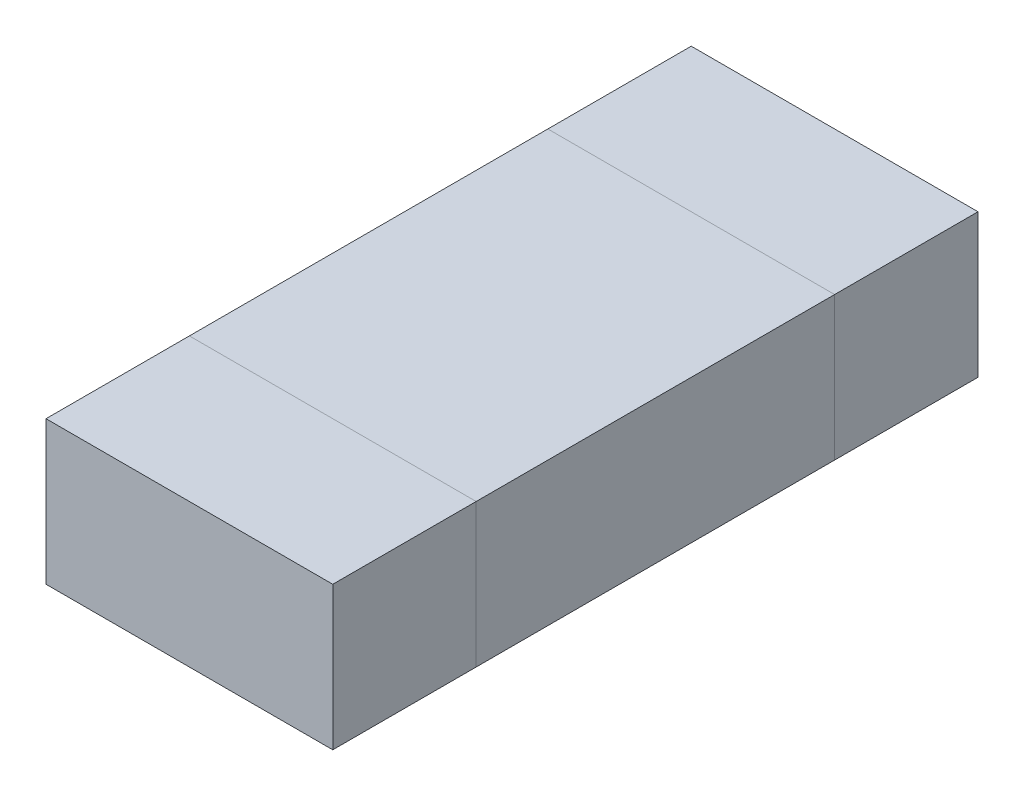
ISO-10303-21;
HEADER;
FILE_DESCRIPTION(('STEP AP214'),'2;1');
FILE_NAME('part.step','',(''),(''),'','','');
FILE_SCHEMA(('AUTOMOTIVE_DESIGN { 1 0 10303 214 1 1 1 1 }'));
ENDSEC;
DATA;
#1=APPLICATION_CONTEXT('core data for automotive mechanical design processes');
#2=APPLICATION_PROTOCOL_DEFINITION('international standard','automotive_design',2000,#1);
#3=PRODUCT_CONTEXT('',#1,'mechanical');
#4=PRODUCT('Part','Part','',(#3));
#5=PRODUCT_RELATED_PRODUCT_CATEGORY('part','',(#4));
#6=PRODUCT_DEFINITION_FORMATION('','',#4);
#7=PRODUCT_DEFINITION_CONTEXT('part definition',#1,'design');
#8=PRODUCT_DEFINITION('design','',#6,#7);
#9=PRODUCT_DEFINITION_SHAPE('','',#8);
#10=(LENGTH_UNIT() NAMED_UNIT(*) SI_UNIT(.MILLI.,.METRE.));
#11=(NAMED_UNIT(*) PLANE_ANGLE_UNIT() SI_UNIT($,.RADIAN.));
#12=(NAMED_UNIT(*) SI_UNIT($,.STERADIAN.) SOLID_ANGLE_UNIT());
#13=UNCERTAINTY_MEASURE_WITH_UNIT(LENGTH_MEASURE(1.E-05),#10,'distance_accuracy_value','');
#14=(GEOMETRIC_REPRESENTATION_CONTEXT(3) GLOBAL_UNCERTAINTY_ASSIGNED_CONTEXT((#13)) GLOBAL_UNIT_ASSIGNED_CONTEXT((#10,
#11,#12)) REPRESENTATION_CONTEXT('',''));
#15=CARTESIAN_POINT('',(0.,0.,0.));
#16=DIRECTION('',(0.,0.,1.));
#17=DIRECTION('',(1.,0.,0.));
#18=AXIS2_PLACEMENT_3D('',#15,#16,#17);
#19=CARTESIAN_POINT('',(0.,0.4,0.));
#20=DIRECTION('',(0.,1.,0.));
#21=DIRECTION('',(0.,0.,1.));
#22=AXIS2_PLACEMENT_3D('',#19,#20,#21);
#23=PLANE('',#22);
#24=DIRECTION('',(0.,0.,-1.));
#25=VECTOR('',#24,1.);
#26=CARTESIAN_POINT('',(-0.4,0.4,-0.5));
#27=LINE('',#26,#25);
#28=CARTESIAN_POINT('',(-0.4,0.4,-0.5));
#29=VERTEX_POINT('',#28);
#30=CARTESIAN_POINT('',(-0.4,0.4,-0.9));
#31=VERTEX_POINT('',#30);
#32=EDGE_CURVE('E55',#29,#31,#27,.T.);
#33=ORIENTED_EDGE('',*,*,#32,.F.);
#34=DIRECTION('',(-1.,0.,0.));
#35=VECTOR('',#34,1.);
#36=CARTESIAN_POINT('',(-0.4,0.4,-0.5));
#37=LINE('',#36,#35);
#38=CARTESIAN_POINT('',(0.4,0.4,-0.5));
#39=VERTEX_POINT('',#38);
#40=EDGE_CURVE('E78',#39,#29,#37,.T.);
#41=ORIENTED_EDGE('',*,*,#40,.F.);
#42=DIRECTION('',(0.,0.,1.));
#43=VECTOR('',#42,1.);
#44=CARTESIAN_POINT('',(0.4,0.4,-0.5));
#45=LINE('',#44,#43);
#46=CARTESIAN_POINT('',(0.4,0.4,-0.9));
#47=VERTEX_POINT('',#46);
#48=EDGE_CURVE('E83',#47,#39,#45,.T.);
#49=ORIENTED_EDGE('',*,*,#48,.F.);
#50=DIRECTION('',(1.,0.,0.));
#51=VECTOR('',#50,1.);
#52=CARTESIAN_POINT('',(-0.4,0.4,-0.9));
#53=LINE('',#52,#51);
#54=EDGE_CURVE('E98',#31,#47,#53,.T.);
#55=ORIENTED_EDGE('',*,*,#54,.F.);
#56=EDGE_LOOP('',(#33,#41,#49,#55));
#57=FACE_BOUND('',#56,.T.);
#58=ADVANCED_FACE('F47',(#57),#23,.T.);
#59=CARTESIAN_POINT('',(0.,0.,0.));
#60=DIRECTION('',(0.,-1.,0.));
#61=DIRECTION('',(0.,0.,-1.));
#62=AXIS2_PLACEMENT_3D('',#59,#60,#61);
#63=PLANE('',#62);
#64=DIRECTION('',(0.,0.,-1.));
#65=VECTOR('',#64,1.);
#66=CARTESIAN_POINT('',(-0.4,0.,-0.5));
#67=LINE('',#66,#65);
#68=CARTESIAN_POINT('',(-0.4,0.,-0.5));
#69=VERTEX_POINT('',#68);
#70=CARTESIAN_POINT('',(-0.4,0.,-0.9));
#71=VERTEX_POINT('',#70);
#72=EDGE_CURVE('E107',#69,#71,#67,.T.);
#73=ORIENTED_EDGE('',*,*,#72,.T.);
#74=DIRECTION('',(1.,0.,0.));
#75=VECTOR('',#74,1.);
#76=CARTESIAN_POINT('',(-0.4,0.,-0.9));
#77=LINE('',#76,#75);
#78=CARTESIAN_POINT('',(0.4,0.,-0.9));
#79=VERTEX_POINT('',#78);
#80=EDGE_CURVE('E96',#71,#79,#77,.T.);
#81=ORIENTED_EDGE('',*,*,#80,.T.);
#82=DIRECTION('',(0.,0.,1.));
#83=VECTOR('',#82,1.);
#84=CARTESIAN_POINT('',(0.4,0.,-0.5));
#85=LINE('',#84,#83);
#86=CARTESIAN_POINT('',(0.4,0.,-0.5));
#87=VERTEX_POINT('',#86);
#88=EDGE_CURVE('E99',#79,#87,#85,.T.);
#89=ORIENTED_EDGE('',*,*,#88,.T.);
#90=DIRECTION('',(-1.,0.,0.));
#91=VECTOR('',#90,1.);
#92=CARTESIAN_POINT('',(-0.4,0.,-0.5));
#93=LINE('',#92,#91);
#94=EDGE_CURVE('E104',#87,#69,#93,.T.);
#95=ORIENTED_EDGE('',*,*,#94,.T.);
#96=EDGE_LOOP('',(#73,#81,#89,#95));
#97=FACE_BOUND('',#96,.T.);
#98=ADVANCED_FACE('F106',(#97),#63,.T.);
#99=CARTESIAN_POINT('',(-0.4,1.29442719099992,-0.9));
#100=DIRECTION('',(0.,0.,-1.));
#101=DIRECTION('',(-1.,0.,0.));
#102=AXIS2_PLACEMENT_3D('',#99,#100,#101);
#103=PLANE('',#102);
#104=DIRECTION('',(0.,-1.,0.));
#105=VECTOR('',#104,1.);
#106=CARTESIAN_POINT('',(-0.4,1.29442719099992,-0.9));
#107=LINE('',#106,#105);
#108=EDGE_CURVE('E12',#31,#71,#107,.T.);
#109=ORIENTED_EDGE('',*,*,#108,.F.);
#110=ORIENTED_EDGE('',*,*,#54,.T.);
#111=DIRECTION('',(0.,-1.,0.));
#112=VECTOR('',#111,1.);
#113=CARTESIAN_POINT('',(0.4,1.29442719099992,-0.9));
#114=LINE('',#113,#112);
#115=EDGE_CURVE('E93',#47,#79,#114,.T.);
#116=ORIENTED_EDGE('',*,*,#115,.T.);
#117=ORIENTED_EDGE('',*,*,#80,.F.);
#118=EDGE_LOOP('',(#109,#110,#116,#117));
#119=FACE_BOUND('',#118,.T.);
#120=ADVANCED_FACE('F94',(#119),#103,.T.);
#121=CARTESIAN_POINT('',(0.4,1.29442719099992,-0.5));
#122=DIRECTION('',(1.,0.,0.));
#123=DIRECTION('',(0.,0.,-1.));
#124=AXIS2_PLACEMENT_3D('',#121,#122,#123);
#125=PLANE('',#124);
#126=ORIENTED_EDGE('',*,*,#115,.F.);
#127=ORIENTED_EDGE('',*,*,#48,.T.);
#128=DIRECTION('',(0.,-1.,0.));
#129=VECTOR('',#128,1.);
#130=CARTESIAN_POINT('',(0.4,1.29442719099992,-0.5));
#131=LINE('',#130,#129);
#132=EDGE_CURVE('E88',#39,#87,#131,.T.);
#133=ORIENTED_EDGE('',*,*,#132,.T.);
#134=ORIENTED_EDGE('',*,*,#88,.F.);
#135=EDGE_LOOP('',(#126,#127,#133,#134));
#136=FACE_BOUND('',#135,.T.);
#137=ADVANCED_FACE('F100',(#136),#125,.T.);
#138=CARTESIAN_POINT('',(-0.4,1.29442719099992,-0.5));
#139=DIRECTION('',(0.,0.,1.));
#140=DIRECTION('',(1.,0.,0.));
#141=AXIS2_PLACEMENT_3D('',#138,#139,#140);
#142=PLANE('',#141);
#143=ORIENTED_EDGE('',*,*,#132,.F.);
#144=ORIENTED_EDGE('',*,*,#40,.T.);
#145=DIRECTION('',(0.,-1.,0.));
#146=VECTOR('',#145,1.);
#147=CARTESIAN_POINT('',(-0.4,1.29442719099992,-0.5));
#148=LINE('',#147,#146);
#149=EDGE_CURVE('E114',#29,#69,#148,.T.);
#150=ORIENTED_EDGE('',*,*,#149,.T.);
#151=ORIENTED_EDGE('',*,*,#94,.F.);
#152=EDGE_LOOP('',(#143,#144,#150,#151));
#153=FACE_BOUND('',#152,.T.);
#154=ADVANCED_FACE('F120',(#153),#142,.T.);
#155=CARTESIAN_POINT('',(-0.4,1.29442719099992,-0.5));
#156=DIRECTION('',(-1.,0.,0.));
#157=DIRECTION('',(0.,0.,1.));
#158=AXIS2_PLACEMENT_3D('',#155,#156,#157);
#159=PLANE('',#158);
#160=ORIENTED_EDGE('',*,*,#149,.F.);
#161=ORIENTED_EDGE('',*,*,#32,.T.);
#162=ORIENTED_EDGE('',*,*,#108,.T.);
#163=ORIENTED_EDGE('',*,*,#72,.F.);
#164=EDGE_LOOP('',(#160,#161,#162,#163));
#165=FACE_BOUND('',#164,.T.);
#166=ADVANCED_FACE('F121',(#165),#159,.T.);
#167=CLOSED_SHELL('',(#58,#98,#120,#137,#154,#166));
#168=MANIFOLD_SOLID_BREP('B2',#167);
#169=CARTESIAN_POINT('',(0.,0.4,0.));
#170=DIRECTION('',(0.,1.,0.));
#171=DIRECTION('',(0.,0.,1.));
#172=AXIS2_PLACEMENT_3D('',#169,#170,#171);
#173=PLANE('',#172);
#174=DIRECTION('',(0.,0.,-1.));
#175=VECTOR('',#174,1.);
#176=CARTESIAN_POINT('',(-0.4,0.4,0.5));
#177=LINE('',#176,#175);
#178=CARTESIAN_POINT('',(-0.4,0.4,0.9));
#179=VERTEX_POINT('',#178);
#180=CARTESIAN_POINT('',(-0.4,0.4,0.5));
#181=VERTEX_POINT('',#180);
#182=EDGE_CURVE('E187',#179,#181,#177,.T.);
#183=ORIENTED_EDGE('',*,*,#182,.F.);
#184=DIRECTION('',(-1.,0.,0.));
#185=VECTOR('',#184,1.);
#186=CARTESIAN_POINT('',(-0.4,0.4,0.9));
#187=LINE('',#186,#185);
#188=CARTESIAN_POINT('',(0.4,0.4,0.9));
#189=VERTEX_POINT('',#188);
#190=EDGE_CURVE('E210',#189,#179,#187,.T.);
#191=ORIENTED_EDGE('',*,*,#190,.F.);
#192=DIRECTION('',(0.,0.,1.));
#193=VECTOR('',#192,1.);
#194=CARTESIAN_POINT('',(0.4,0.4,0.5));
#195=LINE('',#194,#193);
#196=CARTESIAN_POINT('',(0.4,0.4,0.5));
#197=VERTEX_POINT('',#196);
#198=EDGE_CURVE('E215',#197,#189,#195,.T.);
#199=ORIENTED_EDGE('',*,*,#198,.F.);
#200=DIRECTION('',(1.,0.,0.));
#201=VECTOR('',#200,1.);
#202=CARTESIAN_POINT('',(-0.4,0.4,0.5));
#203=LINE('',#202,#201);
#204=EDGE_CURVE('E230',#181,#197,#203,.T.);
#205=ORIENTED_EDGE('',*,*,#204,.F.);
#206=EDGE_LOOP('',(#183,#191,#199,#205));
#207=FACE_BOUND('',#206,.T.);
#208=ADVANCED_FACE('F179',(#207),#173,.T.);
#209=CARTESIAN_POINT('',(0.,0.,0.));
#210=DIRECTION('',(0.,1.,0.));
#211=DIRECTION('',(0.,0.,1.));
#212=AXIS2_PLACEMENT_3D('',#209,#210,#211);
#213=PLANE('',#212);
#214=DIRECTION('',(0.,0.,-1.));
#215=VECTOR('',#214,1.);
#216=CARTESIAN_POINT('',(-0.4,0.,0.5));
#217=LINE('',#216,#215);
#218=CARTESIAN_POINT('',(-0.4,0.,0.9));
#219=VERTEX_POINT('',#218);
#220=CARTESIAN_POINT('',(-0.4,0.,0.5));
#221=VERTEX_POINT('',#220);
#222=EDGE_CURVE('E239',#219,#221,#217,.T.);
#223=ORIENTED_EDGE('',*,*,#222,.T.);
#224=DIRECTION('',(1.,0.,0.));
#225=VECTOR('',#224,1.);
#226=CARTESIAN_POINT('',(-0.4,0.,0.5));
#227=LINE('',#226,#225);
#228=CARTESIAN_POINT('',(0.4,0.,0.5));
#229=VERTEX_POINT('',#228);
#230=EDGE_CURVE('E228',#221,#229,#227,.T.);
#231=ORIENTED_EDGE('',*,*,#230,.T.);
#232=DIRECTION('',(0.,0.,1.));
#233=VECTOR('',#232,1.);
#234=CARTESIAN_POINT('',(0.4,0.,0.5));
#235=LINE('',#234,#233);
#236=CARTESIAN_POINT('',(0.4,0.,0.9));
#237=VERTEX_POINT('',#236);
#238=EDGE_CURVE('E231',#229,#237,#235,.T.);
#239=ORIENTED_EDGE('',*,*,#238,.T.);
#240=DIRECTION('',(-1.,0.,0.));
#241=VECTOR('',#240,1.);
#242=CARTESIAN_POINT('',(-0.4,0.,0.9));
#243=LINE('',#242,#241);
#244=EDGE_CURVE('E236',#237,#219,#243,.T.);
#245=ORIENTED_EDGE('',*,*,#244,.T.);
#246=EDGE_LOOP('',(#223,#231,#239,#245));
#247=FACE_BOUND('',#246,.T.);
#248=ADVANCED_FACE('F238',(#247),#213,.F.);
#249=CARTESIAN_POINT('',(-0.4,1.29442719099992,0.5));
#250=DIRECTION('',(0.,0.,-1.));
#251=DIRECTION('',(-1.,0.,0.));
#252=AXIS2_PLACEMENT_3D('',#249,#250,#251);
#253=PLANE('',#252);
#254=DIRECTION('',(0.,-1.,0.));
#255=VECTOR('',#254,1.);
#256=CARTESIAN_POINT('',(-0.4,1.29442719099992,0.5));
#257=LINE('',#256,#255);
#258=EDGE_CURVE('E45',#181,#221,#257,.T.);
#259=ORIENTED_EDGE('',*,*,#258,.F.);
#260=ORIENTED_EDGE('',*,*,#204,.T.);
#261=DIRECTION('',(0.,-1.,0.));
#262=VECTOR('',#261,1.);
#263=CARTESIAN_POINT('',(0.4,1.29442719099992,0.5));
#264=LINE('',#263,#262);
#265=EDGE_CURVE('E225',#197,#229,#264,.T.);
#266=ORIENTED_EDGE('',*,*,#265,.T.);
#267=ORIENTED_EDGE('',*,*,#230,.F.);
#268=EDGE_LOOP('',(#259,#260,#266,#267));
#269=FACE_BOUND('',#268,.T.);
#270=ADVANCED_FACE('F226',(#269),#253,.T.);
#271=CARTESIAN_POINT('',(0.4,1.29442719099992,0.5));
#272=DIRECTION('',(1.,0.,0.));
#273=DIRECTION('',(0.,0.,-1.));
#274=AXIS2_PLACEMENT_3D('',#271,#272,#273);
#275=PLANE('',#274);
#276=ORIENTED_EDGE('',*,*,#265,.F.);
#277=ORIENTED_EDGE('',*,*,#198,.T.);
#278=DIRECTION('',(0.,-1.,0.));
#279=VECTOR('',#278,1.);
#280=CARTESIAN_POINT('',(0.4,1.29442719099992,0.9));
#281=LINE('',#280,#279);
#282=EDGE_CURVE('E220',#189,#237,#281,.T.);
#283=ORIENTED_EDGE('',*,*,#282,.T.);
#284=ORIENTED_EDGE('',*,*,#238,.F.);
#285=EDGE_LOOP('',(#276,#277,#283,#284));
#286=FACE_BOUND('',#285,.T.);
#287=ADVANCED_FACE('F232',(#286),#275,.T.);
#288=CARTESIAN_POINT('',(-0.4,1.29442719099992,0.9));
#289=DIRECTION('',(0.,0.,1.));
#290=DIRECTION('',(1.,0.,0.));
#291=AXIS2_PLACEMENT_3D('',#288,#289,#290);
#292=PLANE('',#291);
#293=ORIENTED_EDGE('',*,*,#282,.F.);
#294=ORIENTED_EDGE('',*,*,#190,.T.);
#295=DIRECTION('',(0.,-1.,0.));
#296=VECTOR('',#295,1.);
#297=CARTESIAN_POINT('',(-0.4,1.29442719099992,0.9));
#298=LINE('',#297,#296);
#299=EDGE_CURVE('E246',#179,#219,#298,.T.);
#300=ORIENTED_EDGE('',*,*,#299,.T.);
#301=ORIENTED_EDGE('',*,*,#244,.F.);
#302=EDGE_LOOP('',(#293,#294,#300,#301));
#303=FACE_BOUND('',#302,.T.);
#304=ADVANCED_FACE('F252',(#303),#292,.T.);
#305=CARTESIAN_POINT('',(-0.4,1.29442719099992,0.5));
#306=DIRECTION('',(-1.,0.,0.));
#307=DIRECTION('',(0.,0.,1.));
#308=AXIS2_PLACEMENT_3D('',#305,#306,#307);
#309=PLANE('',#308);
#310=ORIENTED_EDGE('',*,*,#299,.F.);
#311=ORIENTED_EDGE('',*,*,#182,.T.);
#312=ORIENTED_EDGE('',*,*,#258,.T.);
#313=ORIENTED_EDGE('',*,*,#222,.F.);
#314=EDGE_LOOP('',(#310,#311,#312,#313));
#315=FACE_BOUND('',#314,.T.);
#316=ADVANCED_FACE('F253',(#315),#309,.T.);
#317=CLOSED_SHELL('',(#208,#248,#270,#287,#304,#316));
#318=MANIFOLD_SOLID_BREP('B6',#317);
#319=CARTESIAN_POINT('',(0.4,0.4,-0.5));
#320=DIRECTION('',(-1.,0.,0.));
#321=DIRECTION('',(0.,0.,1.));
#322=AXIS2_PLACEMENT_3D('',#319,#320,#321);
#323=PLANE('',#322);
#324=DIRECTION('',(0.,0.,-1.));
#325=VECTOR('',#324,1.);
#326=CARTESIAN_POINT('',(0.4,0.,-0.5));
#327=LINE('',#326,#325);
#328=CARTESIAN_POINT('',(0.4,0.,0.5));
#329=VERTEX_POINT('',#328);
#330=CARTESIAN_POINT('',(0.4,0.,-0.5));
#331=VERTEX_POINT('',#330);
#332=EDGE_CURVE('E365',#329,#331,#327,.T.);
#333=ORIENTED_EDGE('',*,*,#332,.T.);
#334=DIRECTION('',(0.,-1.,0.));
#335=VECTOR('',#334,1.);
#336=CARTESIAN_POINT('',(0.4,0.4,-0.5));
#337=LINE('',#336,#335);
#338=CARTESIAN_POINT('',(0.4,0.4,-0.5));
#339=VERTEX_POINT('',#338);
#340=EDGE_CURVE('E177',#339,#331,#337,.T.);
#341=ORIENTED_EDGE('',*,*,#340,.F.);
#342=DIRECTION('',(0.,0.,-1.));
#343=VECTOR('',#342,1.);
#344=CARTESIAN_POINT('',(0.4,0.4,-0.5));
#345=LINE('',#344,#343);
#346=CARTESIAN_POINT('',(0.4,0.4,0.5));
#347=VERTEX_POINT('',#346);
#348=EDGE_CURVE('E353',#347,#339,#345,.T.);
#349=ORIENTED_EDGE('',*,*,#348,.F.);
#350=DIRECTION('',(0.,-1.,0.));
#351=VECTOR('',#350,1.);
#352=CARTESIAN_POINT('',(0.4,0.4,0.5));
#353=LINE('',#352,#351);
#354=EDGE_CURVE('E361',#347,#329,#353,.T.);
#355=ORIENTED_EDGE('',*,*,#354,.T.);
#356=EDGE_LOOP('',(#333,#341,#349,#355));
#357=FACE_BOUND('',#356,.T.);
#358=ADVANCED_FACE('F302',(#357),#323,.F.);
#359=CARTESIAN_POINT('',(-0.4,0.4,-0.5));
#360=DIRECTION('',(0.,0.,1.));
#361=DIRECTION('',(1.,0.,0.));
#362=AXIS2_PLACEMENT_3D('',#359,#360,#361);
#363=PLANE('',#362);
#364=DIRECTION('',(-1.,0.,0.));
#365=VECTOR('',#364,1.);
#366=CARTESIAN_POINT('',(-0.4,0.,-0.5));
#367=LINE('',#366,#365);
#368=CARTESIAN_POINT('',(-0.4,0.,-0.5));
#369=VERTEX_POINT('',#368);
#370=EDGE_CURVE('E357',#331,#369,#367,.T.);
#371=ORIENTED_EDGE('',*,*,#370,.T.);
#372=DIRECTION('',(0.,-1.,0.));
#373=VECTOR('',#372,1.);
#374=CARTESIAN_POINT('',(-0.4,0.4,-0.5));
#375=LINE('',#374,#373);
#376=CARTESIAN_POINT('',(-0.4,0.4,-0.5));
#377=VERTEX_POINT('',#376);
#378=EDGE_CURVE('E310',#377,#369,#375,.T.);
#379=ORIENTED_EDGE('',*,*,#378,.F.);
#380=DIRECTION('',(-1.,0.,0.));
#381=VECTOR('',#380,1.);
#382=CARTESIAN_POINT('',(-0.4,0.4,-0.5));
#383=LINE('',#382,#381);
#384=EDGE_CURVE('E348',#339,#377,#383,.T.);
#385=ORIENTED_EDGE('',*,*,#384,.F.);
#386=ORIENTED_EDGE('',*,*,#340,.T.);
#387=EDGE_LOOP('',(#371,#379,#385,#386));
#388=FACE_BOUND('',#387,.T.);
#389=ADVANCED_FACE('F356',(#388),#363,.F.);
#390=CARTESIAN_POINT('',(-0.4,0.4,-0.5));
#391=DIRECTION('',(1.,0.,0.));
#392=DIRECTION('',(0.,0.,-1.));
#393=AXIS2_PLACEMENT_3D('',#390,#391,#392);
#394=PLANE('',#393);
#395=DIRECTION('',(0.,0.,1.));
#396=VECTOR('',#395,1.);
#397=CARTESIAN_POINT('',(-0.4,0.,-0.5));
#398=LINE('',#397,#396);
#399=CARTESIAN_POINT('',(-0.4,0.,0.5));
#400=VERTEX_POINT('',#399);
#401=EDGE_CURVE('E335',#369,#400,#398,.T.);
#402=ORIENTED_EDGE('',*,*,#401,.T.);
#403=DIRECTION('',(0.,-1.,0.));
#404=VECTOR('',#403,1.);
#405=CARTESIAN_POINT('',(-0.4,0.4,0.5));
#406=LINE('',#405,#404);
#407=CARTESIAN_POINT('',(-0.4,0.4,0.5));
#408=VERTEX_POINT('',#407);
#409=EDGE_CURVE('E358',#408,#400,#406,.T.);
#410=ORIENTED_EDGE('',*,*,#409,.F.);
#411=DIRECTION('',(0.,0.,1.));
#412=VECTOR('',#411,1.);
#413=CARTESIAN_POINT('',(-0.4,0.4,-0.5));
#414=LINE('',#413,#412);
#415=EDGE_CURVE('E351',#377,#408,#414,.T.);
#416=ORIENTED_EDGE('',*,*,#415,.F.);
#417=ORIENTED_EDGE('',*,*,#378,.T.);
#418=EDGE_LOOP('',(#402,#410,#416,#417));
#419=FACE_BOUND('',#418,.T.);
#420=ADVANCED_FACE('F359',(#419),#394,.F.);
#421=CARTESIAN_POINT('',(-0.4,0.4,0.5));
#422=DIRECTION('',(0.,0.,-1.));
#423=DIRECTION('',(-1.,0.,0.));
#424=AXIS2_PLACEMENT_3D('',#421,#422,#423);
#425=PLANE('',#424);
#426=DIRECTION('',(1.,0.,0.));
#427=VECTOR('',#426,1.);
#428=CARTESIAN_POINT('',(-0.4,0.,0.5));
#429=LINE('',#428,#427);
#430=EDGE_CURVE('E341',#400,#329,#429,.T.);
#431=ORIENTED_EDGE('',*,*,#430,.T.);
#432=ORIENTED_EDGE('',*,*,#354,.F.);
#433=DIRECTION('',(1.,0.,0.));
#434=VECTOR('',#433,1.);
#435=CARTESIAN_POINT('',(-0.4,0.4,0.5));
#436=LINE('',#435,#434);
#437=EDGE_CURVE('E318',#408,#347,#436,.T.);
#438=ORIENTED_EDGE('',*,*,#437,.F.);
#439=ORIENTED_EDGE('',*,*,#409,.T.);
#440=EDGE_LOOP('',(#431,#432,#438,#439));
#441=FACE_BOUND('',#440,.T.);
#442=ADVANCED_FACE('F372',(#441),#425,.F.);
#443=CARTESIAN_POINT('',(0.,0.4,0.));
#444=DIRECTION('',(0.,1.,0.));
#445=DIRECTION('',(0.,0.,1.));
#446=AXIS2_PLACEMENT_3D('',#443,#444,#445);
#447=PLANE('',#446);
#448=ORIENTED_EDGE('',*,*,#348,.T.);
#449=ORIENTED_EDGE('',*,*,#384,.T.);
#450=ORIENTED_EDGE('',*,*,#415,.T.);
#451=ORIENTED_EDGE('',*,*,#437,.T.);
#452=EDGE_LOOP('',(#448,#449,#450,#451));
#453=FACE_BOUND('',#452,.T.);
#454=ADVANCED_FACE('F349',(#453),#447,.T.);
#455=CARTESIAN_POINT('',(0.,0.,0.));
#456=DIRECTION('',(0.,1.,0.));
#457=DIRECTION('',(0.,0.,1.));
#458=AXIS2_PLACEMENT_3D('',#455,#456,#457);
#459=PLANE('',#458);
#460=ORIENTED_EDGE('',*,*,#332,.F.);
#461=ORIENTED_EDGE('',*,*,#430,.F.);
#462=ORIENTED_EDGE('',*,*,#401,.F.);
#463=ORIENTED_EDGE('',*,*,#370,.F.);
#464=EDGE_LOOP('',(#460,#461,#462,#463));
#465=FACE_BOUND('',#464,.T.);
#466=ADVANCED_FACE('F375',(#465),#459,.F.);
#467=CLOSED_SHELL('',(#358,#389,#420,#442,#454,#466));
#468=MANIFOLD_SOLID_BREP('B39',#467);
#469=ADVANCED_BREP_SHAPE_REPRESENTATION('',(#18,#168,#318,#468),#14);
#470=SHAPE_DEFINITION_REPRESENTATION(#9,#469);
ENDSEC;
END-ISO-10303-21;
